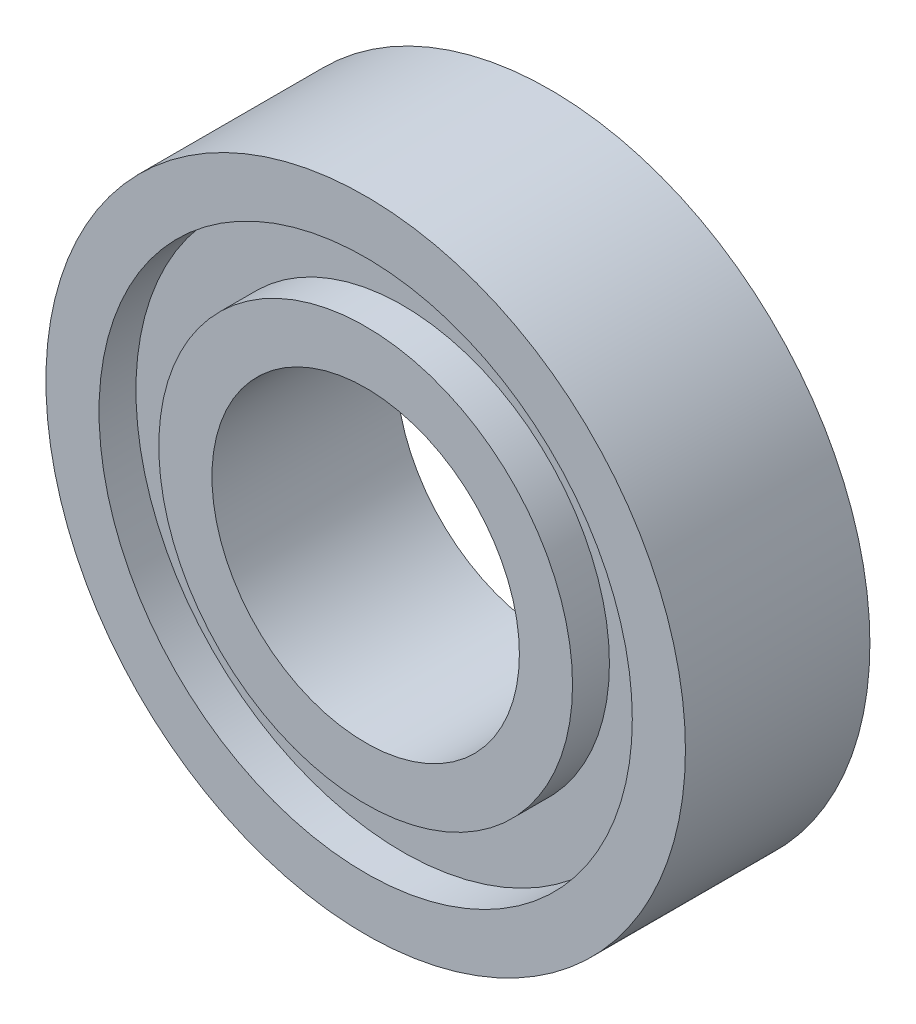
ISO-10303-21;
HEADER;
FILE_DESCRIPTION(('STEP AP214'),'2;1');
FILE_NAME('part.step','',(''),(''),'','','');
FILE_SCHEMA(('AUTOMOTIVE_DESIGN { 1 0 10303 214 1 1 1 1 }'));
ENDSEC;
DATA;
#1=APPLICATION_CONTEXT('core data for automotive mechanical design processes');
#2=APPLICATION_PROTOCOL_DEFINITION('international standard','automotive_design',2000,#1);
#3=PRODUCT_CONTEXT('',#1,'mechanical');
#4=PRODUCT('Part','Part','',(#3));
#5=PRODUCT_RELATED_PRODUCT_CATEGORY('part','',(#4));
#6=PRODUCT_DEFINITION_FORMATION('','',#4);
#7=PRODUCT_DEFINITION_CONTEXT('part definition',#1,'design');
#8=PRODUCT_DEFINITION('design','',#6,#7);
#9=PRODUCT_DEFINITION_SHAPE('','',#8);
#10=(LENGTH_UNIT() NAMED_UNIT(*) SI_UNIT(.MILLI.,.METRE.));
#11=(NAMED_UNIT(*) PLANE_ANGLE_UNIT() SI_UNIT($,.RADIAN.));
#12=(NAMED_UNIT(*) SI_UNIT($,.STERADIAN.) SOLID_ANGLE_UNIT());
#13=UNCERTAINTY_MEASURE_WITH_UNIT(LENGTH_MEASURE(1.E-05),#10,'distance_accuracy_value','');
#14=(GEOMETRIC_REPRESENTATION_CONTEXT(3) GLOBAL_UNCERTAINTY_ASSIGNED_CONTEXT((#13)) GLOBAL_UNIT_ASSIGNED_CONTEXT((#10,
#11,#12)) REPRESENTATION_CONTEXT('',''));
#15=CARTESIAN_POINT('',(0.,0.,0.));
#16=DIRECTION('',(0.,0.,1.));
#17=DIRECTION('',(1.,0.,0.));
#18=AXIS2_PLACEMENT_3D('',#15,#16,#17);
#19=CARTESIAN_POINT('',(0.,0.,7.5));
#20=DIRECTION('',(0.,0.,-1.));
#21=DIRECTION('',(-1.,0.,0.));
#22=AXIS2_PLACEMENT_3D('',#19,#20,#21);
#23=CYLINDRICAL_SURFACE('',#22,21.68);
#24=CARTESIAN_POINT('',(0.,0.,-7.5));
#25=DIRECTION('',(0.,0.,1.));
#26=DIRECTION('',(1.,0.,0.));
#27=AXIS2_PLACEMENT_3D('',#24,#25,#26);
#28=CIRCLE('',#27,21.68);
#29=CARTESIAN_POINT('',(21.68,0.,-7.5));
#30=VERTEX_POINT('',#29);
#31=EDGE_CURVE('E62',#30,#30,#28,.T.);
#32=ORIENTED_EDGE('',*,*,#31,.F.);
#33=EDGE_LOOP('',(#32));
#34=FACE_BOUND('',#33,.T.);
#35=CARTESIAN_POINT('',(0.,0.,-4.5));
#36=DIRECTION('',(0.,0.,1.));
#37=DIRECTION('',(1.,0.,0.));
#38=AXIS2_PLACEMENT_3D('',#35,#36,#37);
#39=CIRCLE('',#38,21.68);
#40=CARTESIAN_POINT('',(21.68,0.,-4.5));
#41=VERTEX_POINT('',#40);
#42=EDGE_CURVE('E65',#41,#41,#39,.T.);
#43=ORIENTED_EDGE('',*,*,#42,.T.);
#44=EDGE_LOOP('',(#43));
#45=FACE_BOUND('',#44,.T.);
#46=ADVANCED_FACE('F41',(#34,#45),#23,.F.);
#47=CARTESIAN_POINT('',(0.,0.,7.5));
#48=DIRECTION('',(0.,0.,1.));
#49=DIRECTION('',(1.,0.,0.));
#50=AXIS2_PLACEMENT_3D('',#47,#48,#49);
#51=PLANE('',#50);
#52=CARTESIAN_POINT('',(0.,0.,7.5));
#53=DIRECTION('',(0.,0.,1.));
#54=DIRECTION('',(1.,0.,0.));
#55=AXIS2_PLACEMENT_3D('',#52,#53,#54);
#56=CIRCLE('',#55,26.);
#57=CARTESIAN_POINT('',(26.,0.,7.5));
#58=VERTEX_POINT('',#57);
#59=EDGE_CURVE('E52',#58,#58,#56,.T.);
#60=ORIENTED_EDGE('',*,*,#59,.T.);
#61=EDGE_LOOP('',(#60));
#62=FACE_BOUND('',#61,.T.);
#63=CARTESIAN_POINT('',(0.,0.,7.5));
#64=DIRECTION('',(0.,0.,1.));
#65=DIRECTION('',(1.,0.,0.));
#66=AXIS2_PLACEMENT_3D('',#63,#64,#65);
#67=CIRCLE('',#66,21.68);
#68=CARTESIAN_POINT('',(21.68,0.,7.5));
#69=VERTEX_POINT('',#68);
#70=EDGE_CURVE('E60',#69,#69,#67,.T.);
#71=ORIENTED_EDGE('',*,*,#70,.F.);
#72=EDGE_LOOP('',(#71));
#73=FACE_BOUND('',#72,.T.);
#74=ADVANCED_FACE('F107',(#62,#73),#51,.T.);
#75=CARTESIAN_POINT('',(0.,0.,-7.5));
#76=DIRECTION('',(0.,0.,1.));
#77=DIRECTION('',(1.,0.,0.));
#78=AXIS2_PLACEMENT_3D('',#75,#76,#77);
#79=PLANE('',#78);
#80=CARTESIAN_POINT('',(0.,0.,-7.5));
#81=DIRECTION('',(0.,0.,1.));
#82=DIRECTION('',(1.,0.,0.));
#83=AXIS2_PLACEMENT_3D('',#80,#81,#82);
#84=CIRCLE('',#83,26.);
#85=CARTESIAN_POINT('',(26.,0.,-7.5));
#86=VERTEX_POINT('',#85);
#87=EDGE_CURVE('E56',#86,#86,#84,.T.);
#88=ORIENTED_EDGE('',*,*,#87,.F.);
#89=EDGE_LOOP('',(#88));
#90=FACE_BOUND('',#89,.T.);
#91=ORIENTED_EDGE('',*,*,#31,.T.);
#92=EDGE_LOOP('',(#91));
#93=FACE_BOUND('',#92,.T.);
#94=ADVANCED_FACE('F116',(#90,#93),#79,.F.);
#95=CARTESIAN_POINT('',(0.,0.,7.5));
#96=DIRECTION('',(0.,0.,-1.));
#97=DIRECTION('',(-1.,0.,0.));
#98=AXIS2_PLACEMENT_3D('',#95,#96,#97);
#99=CYLINDRICAL_SURFACE('',#98,26.);
#100=ORIENTED_EDGE('',*,*,#59,.F.);
#101=EDGE_LOOP('',(#100));
#102=FACE_BOUND('',#101,.T.);
#103=ORIENTED_EDGE('',*,*,#87,.T.);
#104=EDGE_LOOP('',(#103));
#105=FACE_BOUND('',#104,.T.);
#106=ADVANCED_FACE('F43',(#102,#105),#99,.T.);
#107=CARTESIAN_POINT('',(0.,0.,4.5));
#108=DIRECTION('',(0.,0.,1.));
#109=DIRECTION('',(1.,0.,0.));
#110=AXIS2_PLACEMENT_3D('',#107,#108,#109);
#111=CIRCLE('',#110,21.68);
#112=CARTESIAN_POINT('',(21.68,0.,4.5));
#113=VERTEX_POINT('',#112);
#114=EDGE_CURVE('E48',#113,#113,#111,.T.);
#115=ORIENTED_EDGE('',*,*,#114,.F.);
#116=EDGE_LOOP('',(#115));
#117=FACE_BOUND('',#116,.T.);
#118=ORIENTED_EDGE('',*,*,#70,.T.);
#119=EDGE_LOOP('',(#118));
#120=FACE_BOUND('',#119,.T.);
#121=ADVANCED_FACE('F110',(#117,#120),#23,.F.);
#122=CARTESIAN_POINT('',(0.,0.,4.5));
#123=DIRECTION('',(0.,0.,1.));
#124=DIRECTION('',(1.,0.,0.));
#125=AXIS2_PLACEMENT_3D('',#122,#123,#124);
#126=PLANE('',#125);
#127=CARTESIAN_POINT('',(0.,0.,4.5));
#128=DIRECTION('',(0.,0.,1.));
#129=DIRECTION('',(1.,0.,0.));
#130=AXIS2_PLACEMENT_3D('',#127,#128,#129);
#131=CIRCLE('',#130,16.82);
#132=CARTESIAN_POINT('',(16.82,0.,4.5));
#133=VERTEX_POINT('',#132);
#134=EDGE_CURVE('E70',#133,#133,#131,.F.);
#135=ORIENTED_EDGE('',*,*,#134,.T.);
#136=EDGE_LOOP('',(#135));
#137=FACE_BOUND('',#136,.T.);
#138=ORIENTED_EDGE('',*,*,#114,.T.);
#139=EDGE_LOOP('',(#138));
#140=FACE_BOUND('',#139,.T.);
#141=ADVANCED_FACE('F122',(#137,#140),#126,.T.);
#142=CARTESIAN_POINT('',(0.,0.,-4.5));
#143=DIRECTION('',(0.,0.,1.));
#144=DIRECTION('',(1.,0.,0.));
#145=AXIS2_PLACEMENT_3D('',#142,#143,#144);
#146=PLANE('',#145);
#147=CARTESIAN_POINT('',(0.,0.,-4.5));
#148=DIRECTION('',(0.,0.,1.));
#149=DIRECTION('',(1.,0.,0.));
#150=AXIS2_PLACEMENT_3D('',#147,#148,#149);
#151=CIRCLE('',#150,16.82);
#152=CARTESIAN_POINT('',(16.82,0.,-4.5));
#153=VERTEX_POINT('',#152);
#154=EDGE_CURVE('E10',#153,#153,#151,.F.);
#155=ORIENTED_EDGE('',*,*,#154,.F.);
#156=EDGE_LOOP('',(#155));
#157=FACE_BOUND('',#156,.T.);
#158=ORIENTED_EDGE('',*,*,#42,.F.);
#159=EDGE_LOOP('',(#158));
#160=FACE_BOUND('',#159,.T.);
#161=ADVANCED_FACE('F102',(#157,#160),#146,.F.);
#162=CARTESIAN_POINT('',(0.,0.,7.5));
#163=DIRECTION('',(0.,0.,-1.));
#164=DIRECTION('',(-1.,0.,0.));
#165=AXIS2_PLACEMENT_3D('',#162,#163,#164);
#166=CYLINDRICAL_SURFACE('',#165,16.82);
#167=CARTESIAN_POINT('',(0.,0.,-7.5));
#168=DIRECTION('',(0.,0.,1.));
#169=DIRECTION('',(1.,0.,0.));
#170=AXIS2_PLACEMENT_3D('',#167,#168,#169);
#171=CIRCLE('',#170,16.82);
#172=CARTESIAN_POINT('',(16.82,0.,-7.5));
#173=VERTEX_POINT('',#172);
#174=EDGE_CURVE('E74',#173,#173,#171,.T.);
#175=ORIENTED_EDGE('',*,*,#174,.T.);
#176=EDGE_LOOP('',(#175));
#177=FACE_BOUND('',#176,.T.);
#178=ORIENTED_EDGE('',*,*,#154,.T.);
#179=EDGE_LOOP('',(#178));
#180=FACE_BOUND('',#179,.T.);
#181=ADVANCED_FACE('F92',(#177,#180),#166,.T.);
#182=CARTESIAN_POINT('',(0.,0.,7.5));
#183=DIRECTION('',(0.,0.,1.));
#184=DIRECTION('',(1.,0.,0.));
#185=AXIS2_PLACEMENT_3D('',#182,#183,#184);
#186=PLANE('',#185);
#187=CARTESIAN_POINT('',(0.,0.,7.5));
#188=DIRECTION('',(0.,0.,1.));
#189=DIRECTION('',(1.,0.,0.));
#190=AXIS2_PLACEMENT_3D('',#187,#188,#189);
#191=CIRCLE('',#190,16.82);
#192=CARTESIAN_POINT('',(16.82,0.,7.5));
#193=VERTEX_POINT('',#192);
#194=EDGE_CURVE('E73',#193,#193,#191,.T.);
#195=ORIENTED_EDGE('',*,*,#194,.T.);
#196=EDGE_LOOP('',(#195));
#197=FACE_BOUND('',#196,.T.);
#198=CARTESIAN_POINT('',(0.,0.,7.5));
#199=DIRECTION('',(0.,0.,1.));
#200=DIRECTION('',(1.,0.,0.));
#201=AXIS2_PLACEMENT_3D('',#198,#199,#200);
#202=CIRCLE('',#201,12.5);
#203=CARTESIAN_POINT('',(12.5,0.,7.5));
#204=VERTEX_POINT('',#203);
#205=EDGE_CURVE('E77',#204,#204,#202,.T.);
#206=ORIENTED_EDGE('',*,*,#205,.F.);
#207=EDGE_LOOP('',(#206));
#208=FACE_BOUND('',#207,.T.);
#209=ADVANCED_FACE('F89',(#197,#208),#186,.T.);
#210=CARTESIAN_POINT('',(0.,0.,-7.5));
#211=DIRECTION('',(0.,0.,1.));
#212=DIRECTION('',(1.,0.,0.));
#213=AXIS2_PLACEMENT_3D('',#210,#211,#212);
#214=PLANE('',#213);
#215=ORIENTED_EDGE('',*,*,#174,.F.);
#216=EDGE_LOOP('',(#215));
#217=FACE_BOUND('',#216,.T.);
#218=CARTESIAN_POINT('',(0.,0.,-7.5));
#219=DIRECTION('',(0.,0.,1.));
#220=DIRECTION('',(1.,0.,0.));
#221=AXIS2_PLACEMENT_3D('',#218,#219,#220);
#222=CIRCLE('',#221,12.5);
#223=CARTESIAN_POINT('',(12.5,0.,-7.5));
#224=VERTEX_POINT('',#223);
#225=EDGE_CURVE('E80',#224,#224,#222,.T.);
#226=ORIENTED_EDGE('',*,*,#225,.T.);
#227=EDGE_LOOP('',(#226));
#228=FACE_BOUND('',#227,.T.);
#229=ADVANCED_FACE('F91',(#217,#228),#214,.F.);
#230=ORIENTED_EDGE('',*,*,#134,.F.);
#231=EDGE_LOOP('',(#230));
#232=FACE_BOUND('',#231,.T.);
#233=ORIENTED_EDGE('',*,*,#194,.F.);
#234=EDGE_LOOP('',(#233));
#235=FACE_BOUND('',#234,.T.);
#236=ADVANCED_FACE('F99',(#232,#235),#166,.T.);
#237=CARTESIAN_POINT('',(0.,0.,7.5));
#238=DIRECTION('',(0.,0.,-1.));
#239=DIRECTION('',(-1.,0.,0.));
#240=AXIS2_PLACEMENT_3D('',#237,#238,#239);
#241=CYLINDRICAL_SURFACE('',#240,12.5);
#242=ORIENTED_EDGE('',*,*,#205,.T.);
#243=EDGE_LOOP('',(#242));
#244=FACE_BOUND('',#243,.T.);
#245=ORIENTED_EDGE('',*,*,#225,.F.);
#246=EDGE_LOOP('',(#245));
#247=FACE_BOUND('',#246,.T.);
#248=ADVANCED_FACE('F86',(#244,#247),#241,.F.);
#249=CLOSED_SHELL('',(#46,#74,#94,#106,#121,#141,#161,#181,#209,#229,#236,#248));
#250=MANIFOLD_SOLID_BREP('B2',#249);
#251=ADVANCED_BREP_SHAPE_REPRESENTATION('',(#18,#250),#14);
#252=SHAPE_DEFINITION_REPRESENTATION(#9,#251);
ENDSEC;
END-ISO-10303-21;
